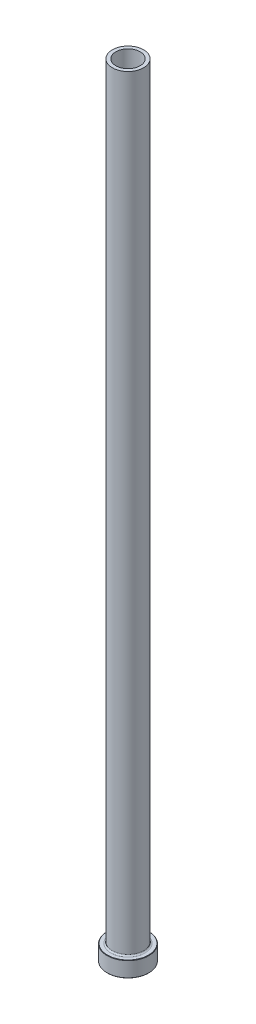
ISO-10303-21;
HEADER;
FILE_DESCRIPTION(('STEP AP214'),'2;1');
FILE_NAME('part.step','',(''),(''),'','','');
FILE_SCHEMA(('AUTOMOTIVE_DESIGN { 1 0 10303 214 1 1 1 1 }'));
ENDSEC;
DATA;
#1=APPLICATION_CONTEXT('core data for automotive mechanical design processes');
#2=APPLICATION_PROTOCOL_DEFINITION('international standard','automotive_design',2000,#1);
#3=PRODUCT_CONTEXT('',#1,'mechanical');
#4=PRODUCT('Part','Part','',(#3));
#5=PRODUCT_RELATED_PRODUCT_CATEGORY('part','',(#4));
#6=PRODUCT_DEFINITION_FORMATION('','',#4);
#7=PRODUCT_DEFINITION_CONTEXT('part definition',#1,'design');
#8=PRODUCT_DEFINITION('design','',#6,#7);
#9=PRODUCT_DEFINITION_SHAPE('','',#8);
#10=(LENGTH_UNIT() NAMED_UNIT(*) SI_UNIT(.MILLI.,.METRE.));
#11=(NAMED_UNIT(*) PLANE_ANGLE_UNIT() SI_UNIT($,.RADIAN.));
#12=(NAMED_UNIT(*) SI_UNIT($,.STERADIAN.) SOLID_ANGLE_UNIT());
#13=UNCERTAINTY_MEASURE_WITH_UNIT(LENGTH_MEASURE(1.E-05),#10,'distance_accuracy_value','');
#14=(GEOMETRIC_REPRESENTATION_CONTEXT(3) GLOBAL_UNCERTAINTY_ASSIGNED_CONTEXT((#13)) GLOBAL_UNIT_ASSIGNED_CONTEXT((#10,
#11,#12)) REPRESENTATION_CONTEXT('',''));
#15=CARTESIAN_POINT('',(0.,0.,0.));
#16=DIRECTION('',(0.,0.,1.));
#17=DIRECTION('',(1.,0.,0.));
#18=AXIS2_PLACEMENT_3D('',#15,#16,#17);
#19=CARTESIAN_POINT('',(0.,92.1876809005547,0.));
#20=DIRECTION('',(0.,1.,0.));
#21=DIRECTION('',(0.,0.,1.));
#22=AXIS2_PLACEMENT_3D('',#19,#20,#21);
#23=CYLINDRICAL_SURFACE('',#22,7.00000000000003);
#24=CARTESIAN_POINT('',(0.,450.,0.));
#25=DIRECTION('',(0.,1.,0.));
#26=DIRECTION('',(0.,0.,1.));
#27=AXIS2_PLACEMENT_3D('',#24,#25,#26);
#28=CIRCLE('',#27,7.00000000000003);
#29=CARTESIAN_POINT('',(0.,450.,7.00000000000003));
#30=VERTEX_POINT('',#29);
#31=EDGE_CURVE('E62',#30,#30,#28,.T.);
#32=ORIENTED_EDGE('',*,*,#31,.T.);
#33=EDGE_LOOP('',(#32));
#34=FACE_BOUND('',#33,.T.);
#35=CARTESIAN_POINT('',(0.,395.,0.));
#36=DIRECTION('',(0.,1.,0.));
#37=DIRECTION('',(0.,0.,1.));
#38=AXIS2_PLACEMENT_3D('',#35,#36,#37);
#39=CIRCLE('',#38,7.00000000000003);
#40=CARTESIAN_POINT('',(0.,395.,7.00000000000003));
#41=VERTEX_POINT('',#40);
#42=EDGE_CURVE('E71',#41,#41,#39,.T.);
#43=ORIENTED_EDGE('',*,*,#42,.F.);
#44=EDGE_LOOP('',(#43));
#45=FACE_BOUND('',#44,.T.);
#46=ADVANCED_FACE('F30',(#34,#45),#23,.F.);
#47=CARTESIAN_POINT('',(-7.00000000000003,450.,0.));
#48=DIRECTION('',(0.,1.,0.));
#49=DIRECTION('',(0.,0.,1.));
#50=AXIS2_PLACEMENT_3D('',#47,#48,#49);
#51=PLANE('',#50);
#52=CARTESIAN_POINT('',(0.,450.,0.));
#53=DIRECTION('',(0.,1.,0.));
#54=DIRECTION('',(0.,0.,1.));
#55=AXIS2_PLACEMENT_3D('',#52,#53,#54);
#56=CIRCLE('',#55,9.00000000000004);
#57=CARTESIAN_POINT('',(0.,450.,9.00000000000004));
#58=VERTEX_POINT('',#57);
#59=EDGE_CURVE('E65',#58,#58,#56,.T.);
#60=ORIENTED_EDGE('',*,*,#59,.T.);
#61=EDGE_LOOP('',(#60));
#62=FACE_BOUND('',#61,.T.);
#63=ORIENTED_EDGE('',*,*,#31,.F.);
#64=EDGE_LOOP('',(#63));
#65=FACE_BOUND('',#64,.T.);
#66=ADVANCED_FACE('F79',(#62,#65),#51,.T.);
#67=CARTESIAN_POINT('',(0.,92.1876809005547,0.));
#68=DIRECTION('',(0.,1.,0.));
#69=DIRECTION('',(0.,0.,1.));
#70=AXIS2_PLACEMENT_3D('',#67,#68,#69);
#71=CYLINDRICAL_SURFACE('',#70,9.00000000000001);
#72=CARTESIAN_POINT('',(0.,9.8,0.));
#73=DIRECTION('',(0.,1.,0.));
#74=DIRECTION('',(0.,0.,1.));
#75=AXIS2_PLACEMENT_3D('',#72,#73,#74);
#76=CIRCLE('',#75,9.00000000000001);
#77=CARTESIAN_POINT('',(0.,9.8,9.00000000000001));
#78=VERTEX_POINT('',#77);
#79=EDGE_CURVE('E59',#78,#78,#76,.T.);
#80=ORIENTED_EDGE('',*,*,#79,.T.);
#81=EDGE_LOOP('',(#80));
#82=FACE_BOUND('',#81,.T.);
#83=ORIENTED_EDGE('',*,*,#59,.F.);
#84=EDGE_LOOP('',(#83));
#85=FACE_BOUND('',#84,.T.);
#86=ADVANCED_FACE('F85',(#82,#85),#71,.T.);
#87=CARTESIAN_POINT('',(-8.99999999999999,9.,0.));
#88=DIRECTION('',(0.,1.,0.));
#89=DIRECTION('',(0.,0.,1.));
#90=AXIS2_PLACEMENT_3D('',#87,#88,#89);
#91=PLANE('',#90);
#92=CARTESIAN_POINT('',(0.,9.,0.));
#93=DIRECTION('',(0.,1.,0.));
#94=DIRECTION('',(0.,0.,1.));
#95=AXIS2_PLACEMENT_3D('',#92,#93,#94);
#96=CIRCLE('',#95,11.8);
#97=CARTESIAN_POINT('',(0.,9.,11.8));
#98=VERTEX_POINT('',#97);
#99=EDGE_CURVE('E53',#98,#98,#96,.T.);
#100=ORIENTED_EDGE('',*,*,#99,.T.);
#101=EDGE_LOOP('',(#100));
#102=FACE_BOUND('',#101,.T.);
#103=CARTESIAN_POINT('',(0.,9.,0.));
#104=DIRECTION('',(0.,1.,0.));
#105=DIRECTION('',(0.,0.,1.));
#106=AXIS2_PLACEMENT_3D('',#103,#104,#105);
#107=CIRCLE('',#106,9.80000000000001);
#108=CARTESIAN_POINT('',(0.,9.,9.80000000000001));
#109=VERTEX_POINT('',#108);
#110=EDGE_CURVE('E56',#109,#109,#107,.F.);
#111=ORIENTED_EDGE('',*,*,#110,.T.);
#112=EDGE_LOOP('',(#111));
#113=FACE_BOUND('',#112,.T.);
#114=ADVANCED_FACE('F111',(#102,#113),#91,.T.);
#115=CARTESIAN_POINT('',(0.,92.1876809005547,0.));
#116=DIRECTION('',(0.,1.,0.));
#117=DIRECTION('',(0.,0.,1.));
#118=AXIS2_PLACEMENT_3D('',#115,#116,#117);
#119=CYLINDRICAL_SURFACE('',#118,12.);
#120=CARTESIAN_POINT('',(0.,8.80000000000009,0.));
#121=DIRECTION('',(0.,1.,0.));
#122=DIRECTION('',(0.,0.,1.));
#123=AXIS2_PLACEMENT_3D('',#120,#121,#122);
#124=CIRCLE('',#123,12.);
#125=CARTESIAN_POINT('',(0.,8.80000000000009,12.));
#126=VERTEX_POINT('',#125);
#127=EDGE_CURVE('E45',#126,#126,#124,.F.);
#128=CARTESIAN_POINT('',(0.,0.199999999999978,0.));
#129=DIRECTION('',(0.,-1.,0.));
#130=DIRECTION('',(0.,0.,-1.));
#131=AXIS2_PLACEMENT_3D('',#128,#129,#130);
#132=CIRCLE('',#131,12.);
#133=CARTESIAN_POINT('',(0.,0.199999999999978,12.));
#134=VERTEX_POINT('',#133);
#135=EDGE_CURVE('E50',#134,#134,#132,.F.);
#136=CARTESIAN_POINT('',(0.,8.80000000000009,12.));
#137=CARTESIAN_POINT('',(0.,8.71041666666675,12.));
#138=CARTESIAN_POINT('',(0.,8.62083333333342,12.));
#139=CARTESIAN_POINT('',(0.,8.44166666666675,12.));
#140=CARTESIAN_POINT('',(0.,8.35208333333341,12.));
#141=CARTESIAN_POINT('',(0.,8.17291666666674,12.));
#142=CARTESIAN_POINT('',(0.,8.08333333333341,12.));
#143=CARTESIAN_POINT('',(0.,7.90416666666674,12.));
#144=CARTESIAN_POINT('',(0.,7.8145833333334,12.));
#145=CARTESIAN_POINT('',(0.,7.63541666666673,12.));
#146=CARTESIAN_POINT('',(0.,7.5458333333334,12.));
#147=CARTESIAN_POINT('',(0.,7.36666666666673,12.));
#148=CARTESIAN_POINT('',(0.,7.2770833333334,12.));
#149=CARTESIAN_POINT('',(0.,7.09791666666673,12.));
#150=CARTESIAN_POINT('',(0.,7.00833333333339,12.));
#151=CARTESIAN_POINT('',(0.,6.82916666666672,12.));
#152=CARTESIAN_POINT('',(0.,6.73958333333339,12.));
#153=CARTESIAN_POINT('',(0.,6.56041666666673,12.));
#154=CARTESIAN_POINT('',(0.,6.47083333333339,12.));
#155=CARTESIAN_POINT('',(0.,6.29166666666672,12.));
#156=CARTESIAN_POINT('',(0.,6.20208333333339,12.));
#157=CARTESIAN_POINT('',(0.,6.02291666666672,12.));
#158=CARTESIAN_POINT('',(0.,5.93333333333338,12.));
#159=CARTESIAN_POINT('',(0.,5.75416666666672,12.));
#160=CARTESIAN_POINT('',(0.,5.66458333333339,12.));
#161=CARTESIAN_POINT('',(0.,5.48541666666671,12.));
#162=CARTESIAN_POINT('',(0.,5.39583333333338,12.));
#163=CARTESIAN_POINT('',(0.,5.21666666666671,12.));
#164=CARTESIAN_POINT('',(0.,5.12708333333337,12.));
#165=CARTESIAN_POINT('',(0.,4.9479166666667,12.));
#166=CARTESIAN_POINT('',(0.,4.85833333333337,12.));
#167=CARTESIAN_POINT('',(0.,4.6791666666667,12.));
#168=CARTESIAN_POINT('',(0.,4.58958333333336,12.));
#169=CARTESIAN_POINT('',(0.,4.4104166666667,12.));
#170=CARTESIAN_POINT('',(0.,4.32083333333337,12.));
#171=CARTESIAN_POINT('',(0.,4.1416666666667,12.));
#172=CARTESIAN_POINT('',(0.,4.05208333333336,12.));
#173=CARTESIAN_POINT('',(0.,3.87291666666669,12.));
#174=CARTESIAN_POINT('',(0.,3.78333333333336,12.));
#175=CARTESIAN_POINT('',(0.,3.60416666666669,12.));
#176=CARTESIAN_POINT('',(0.,3.51458333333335,12.));
#177=CARTESIAN_POINT('',(0.,3.33541666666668,12.));
#178=CARTESIAN_POINT('',(0.,3.24583333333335,12.));
#179=CARTESIAN_POINT('',(0.,3.06666666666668,12.));
#180=CARTESIAN_POINT('',(0.,2.97708333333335,12.));
#181=CARTESIAN_POINT('',(0.,2.79791666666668,12.));
#182=CARTESIAN_POINT('',(0.,2.70833333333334,12.));
#183=CARTESIAN_POINT('',(0.,2.52916666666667,12.));
#184=CARTESIAN_POINT('',(0.,2.43958333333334,12.));
#185=CARTESIAN_POINT('',(0.,2.26041666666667,12.));
#186=CARTESIAN_POINT('',(0.,2.17083333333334,12.));
#187=CARTESIAN_POINT('',(0.,1.99166666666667,12.));
#188=CARTESIAN_POINT('',(0.,1.90208333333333,12.));
#189=CARTESIAN_POINT('',(0.,1.72291666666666,12.));
#190=CARTESIAN_POINT('',(0.,1.63333333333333,12.));
#191=CARTESIAN_POINT('',(0.,1.45416666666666,12.));
#192=CARTESIAN_POINT('',(0.,1.36458333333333,12.));
#193=CARTESIAN_POINT('',(0.,1.18541666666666,12.));
#194=CARTESIAN_POINT('',(0.,1.09583333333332,12.));
#195=CARTESIAN_POINT('',(0.,0.916666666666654,12.));
#196=CARTESIAN_POINT('',(0.,0.827083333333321,12.));
#197=CARTESIAN_POINT('',(0.,0.647916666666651,12.));
#198=CARTESIAN_POINT('',(0.,0.558333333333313,12.));
#199=CARTESIAN_POINT('',(0.,0.379166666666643,12.));
#200=CARTESIAN_POINT('',(0.,0.289583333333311,12.));
#201=CARTESIAN_POINT('',(0.,0.199999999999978,12.));
#202=B_SPLINE_CURVE_WITH_KNOTS('',3,(#136,#137,#138,#139,#140,#141,#142,#143,#144,#145,#146,
#147,#148,#149,#150,#151,#152,#153,#154,#155,#156,#157,#158,#159,#160,#161,#162,#163,#164,#165,
#166,#167,#168,#169,#170,#171,#172,#173,#174,#175,#176,#177,#178,#179,#180,#181,#182,#183,#184,
#185,#186,#187,#188,#189,#190,#191,#192,#193,#194,#195,#196,#197,#198,#199,#200,#201),
.UNSPECIFIED.,.F.,.F.,(4,2,2,2,2,2,2,2,2,2,2,2,2,2,2,2,2,2,2,2,2,2,2,2,2,2,2,2,2,2,2,2,4),(0.,
0.268749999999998,0.53750000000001,0.806250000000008,1.07500000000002,1.34375000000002,
1.61250000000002,1.88125000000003,2.15000000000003,2.41875000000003,2.68750000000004,
2.95625000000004,3.22500000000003,3.49375000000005,3.76250000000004,4.03125000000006,
4.30000000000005,4.56875000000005,4.83750000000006,5.10625000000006,5.37500000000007,
5.64375000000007,5.91250000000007,6.18125000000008,6.45000000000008,6.71875000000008,
6.98750000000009,7.25625000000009,7.52500000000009,7.7937500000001,8.0625000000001,
8.33125000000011,8.60000000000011),.UNSPECIFIED.);
#203=EDGE_CURVE('BSEAM108',#126,#134,#202,.T.);
#204=ORIENTED_EDGE('',*,*,#127,.T.);
#205=ORIENTED_EDGE('',*,*,#135,.T.);
#206=ORIENTED_EDGE('',*,*,#203,.T.);
#207=ORIENTED_EDGE('',*,*,#203,.F.);
#208=EDGE_LOOP('',(#204,#206,#205,#207));
#209=FACE_BOUND('',#208,.T.);
#210=ADVANCED_FACE('F108',(#209),#119,.T.);
#211=CARTESIAN_POINT('',(-12.,0.,0.));
#212=DIRECTION('',(0.,-1.,0.));
#213=DIRECTION('',(0.,0.,-1.));
#214=AXIS2_PLACEMENT_3D('',#211,#212,#213);
#215=PLANE('',#214);
#216=CARTESIAN_POINT('',(0.,0.,0.));
#217=DIRECTION('',(0.,-1.,0.));
#218=DIRECTION('',(0.,0.,-1.));
#219=AXIS2_PLACEMENT_3D('',#216,#217,#218);
#220=CIRCLE('',#219,7.74999999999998);
#221=CARTESIAN_POINT('',(0.,0.,-7.74999999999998));
#222=VERTEX_POINT('',#221);
#223=EDGE_CURVE('E37',#222,#222,#220,.F.);
#224=ORIENTED_EDGE('',*,*,#223,.T.);
#225=EDGE_LOOP('',(#224));
#226=FACE_BOUND('',#225,.T.);
#227=CARTESIAN_POINT('',(0.,0.,0.));
#228=DIRECTION('',(0.,-1.,0.));
#229=DIRECTION('',(0.,0.,-1.));
#230=AXIS2_PLACEMENT_3D('',#227,#228,#229);
#231=CIRCLE('',#230,11.8);
#232=CARTESIAN_POINT('',(0.,0.,11.8));
#233=VERTEX_POINT('',#232);
#234=EDGE_CURVE('E41',#233,#233,#231,.T.);
#235=ORIENTED_EDGE('',*,*,#234,.T.);
#236=EDGE_LOOP('',(#235));
#237=FACE_BOUND('',#236,.T.);
#238=ADVANCED_FACE('F110',(#226,#237),#215,.T.);
#239=CARTESIAN_POINT('',(0.,92.1876809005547,0.));
#240=DIRECTION('',(0.,1.,0.));
#241=DIRECTION('',(0.,0.,1.));
#242=AXIS2_PLACEMENT_3D('',#239,#240,#241);
#243=CYLINDRICAL_SURFACE('',#242,7.25000000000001);
#244=CARTESIAN_POINT('',(0.,0.5,0.));
#245=DIRECTION('',(0.,-1.,0.));
#246=DIRECTION('',(0.,0.,-1.));
#247=AXIS2_PLACEMENT_3D('',#244,#245,#246);
#248=CIRCLE('',#247,7.25000000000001);
#249=CARTESIAN_POINT('',(0.,0.5,-7.25000000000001));
#250=VERTEX_POINT('',#249);
#251=EDGE_CURVE('E10',#250,#250,#248,.T.);
#252=ORIENTED_EDGE('',*,*,#251,.T.);
#253=EDGE_LOOP('',(#252));
#254=FACE_BOUND('',#253,.T.);
#255=CARTESIAN_POINT('',(0.,383.,0.));
#256=DIRECTION('',(0.,1.,0.));
#257=DIRECTION('',(0.,0.,1.));
#258=AXIS2_PLACEMENT_3D('',#255,#256,#257);
#259=CIRCLE('',#258,7.25000000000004);
#260=CARTESIAN_POINT('',(0.,383.,7.25000000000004));
#261=VERTEX_POINT('',#260);
#262=EDGE_CURVE('E68',#261,#261,#259,.T.);
#263=ORIENTED_EDGE('',*,*,#262,.T.);
#264=EDGE_LOOP('',(#263));
#265=FACE_BOUND('',#264,.T.);
#266=ADVANCED_FACE('F118',(#254,#265),#243,.F.);
#267=CARTESIAN_POINT('',(0.,383.,0.));
#268=DIRECTION('',(0.,-1.,0.));
#269=DIRECTION('',(0.,0.,-1.));
#270=AXIS2_PLACEMENT_3D('',#267,#268,#269);
#271=CONICAL_SURFACE('',#270,7.25000000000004,0.0208303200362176);
#272=ORIENTED_EDGE('',*,*,#42,.T.);
#273=EDGE_LOOP('',(#272));
#274=FACE_BOUND('',#273,.T.);
#275=ORIENTED_EDGE('',*,*,#262,.F.);
#276=EDGE_LOOP('',(#275));
#277=FACE_BOUND('',#276,.T.);
#278=ADVANCED_FACE('F75',(#274,#277),#271,.F.);
#279=CARTESIAN_POINT('',(0.,9.8,0.));
#280=DIRECTION('',(0.,1.,0.));
#281=DIRECTION('',(0.,0.,1.));
#282=AXIS2_PLACEMENT_3D('',#279,#280,#281);
#283=TOROIDAL_SURFACE('',#282,9.80000000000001,0.8);
#284=ORIENTED_EDGE('',*,*,#110,.F.);
#285=EDGE_LOOP('',(#284));
#286=FACE_BOUND('',#285,.T.);
#287=ORIENTED_EDGE('',*,*,#79,.F.);
#288=EDGE_LOOP('',(#287));
#289=FACE_BOUND('',#288,.T.);
#290=ADVANCED_FACE('F90',(#286,#289),#283,.F.);
#291=CARTESIAN_POINT('',(0.,9.00000000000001,0.));
#292=DIRECTION('',(0.,-1.,0.));
#293=DIRECTION('',(0.,0.,-1.));
#294=AXIS2_PLACEMENT_3D('',#291,#292,#293);
#295=CONICAL_SURFACE('',#294,11.8,0.785398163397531);
#296=ORIENTED_EDGE('',*,*,#127,.F.);
#297=EDGE_LOOP('',(#296));
#298=FACE_BOUND('',#297,.T.);
#299=ORIENTED_EDGE('',*,*,#99,.F.);
#300=EDGE_LOOP('',(#299));
#301=FACE_BOUND('',#300,.T.);
#302=ADVANCED_FACE('F93',(#298,#301),#295,.T.);
#303=CARTESIAN_POINT('',(0.,0.199999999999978,0.));
#304=DIRECTION('',(0.,1.,0.));
#305=DIRECTION('',(0.,0.,1.));
#306=AXIS2_PLACEMENT_3D('',#303,#304,#305);
#307=CONICAL_SURFACE('',#306,12.,0.785398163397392);
#308=CARTESIAN_POINT('',(0.,0.,11.8));
#309=CARTESIAN_POINT('',(0.,0.00208333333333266,11.8020833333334));
#310=CARTESIAN_POINT('',(0.,0.00416666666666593,11.8041666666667));
#311=CARTESIAN_POINT('',(0.,0.00833333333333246,11.8083333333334));
#312=CARTESIAN_POINT('',(0.,0.0104166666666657,11.8104166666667));
#313=CARTESIAN_POINT('',(0.,0.0145833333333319,11.8145833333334));
#314=CARTESIAN_POINT('',(0.,0.0166666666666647,11.8166666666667));
#315=CARTESIAN_POINT('',(0.,0.0208333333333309,11.8208333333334));
#316=CARTESIAN_POINT('',(0.,0.0229166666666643,11.8229166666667));
#317=CARTESIAN_POINT('',(0.,0.0270833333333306,11.8270833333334));
#318=CARTESIAN_POINT('',(0.,0.0291666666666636,11.8291666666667));
#319=CARTESIAN_POINT('',(0.,0.0333333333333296,11.8333333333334));
#320=CARTESIAN_POINT('',(0.,0.0354166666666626,11.8354166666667));
#321=CARTESIAN_POINT('',(0.,0.0395833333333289,11.8395833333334));
#322=CARTESIAN_POINT('',(0.,0.0416666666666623,11.8416666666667));
#323=CARTESIAN_POINT('',(0.,0.0458333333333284,11.8458333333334));
#324=CARTESIAN_POINT('',(0.,0.0479166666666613,11.8479166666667));
#325=CARTESIAN_POINT('',(0.,0.0520833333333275,11.8520833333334));
#326=CARTESIAN_POINT('',(0.,0.0541666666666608,11.8541666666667));
#327=CARTESIAN_POINT('',(0.,0.0583333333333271,11.8583333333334));
#328=CARTESIAN_POINT('',(0.,0.0604166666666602,11.8604166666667));
#329=CARTESIAN_POINT('',(0.,0.0645833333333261,11.8645833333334));
#330=CARTESIAN_POINT('',(0.,0.0666666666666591,11.8666666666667));
#331=CARTESIAN_POINT('',(0.,0.0708333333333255,11.8708333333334));
#332=CARTESIAN_POINT('',(0.,0.0729166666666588,11.8729166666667));
#333=CARTESIAN_POINT('',(0.,0.077083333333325,11.8770833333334));
#334=CARTESIAN_POINT('',(0.,0.0791666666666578,11.8791666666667));
#335=CARTESIAN_POINT('',(0.,0.083333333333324,11.8833333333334));
#336=CARTESIAN_POINT('',(0.,0.0854166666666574,11.8854166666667));
#337=CARTESIAN_POINT('',(0.,0.0895833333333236,11.8895833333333));
#338=CARTESIAN_POINT('',(0.,0.0916666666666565,11.8916666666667));
#339=CARTESIAN_POINT('',(0.,0.0958333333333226,11.8958333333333));
#340=CARTESIAN_POINT('',(0.,0.097916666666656,11.8979166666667));
#341=CARTESIAN_POINT('',(0.,0.102083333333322,11.9020833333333));
#342=CARTESIAN_POINT('',(0.,0.104166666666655,11.9041666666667));
#343=CARTESIAN_POINT('',(0.,0.108333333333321,11.9083333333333));
#344=CARTESIAN_POINT('',(0.,0.110416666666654,11.9104166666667));
#345=CARTESIAN_POINT('',(0.,0.114583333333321,11.9145833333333));
#346=CARTESIAN_POINT('',(0.,0.116666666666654,11.9166666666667));
#347=CARTESIAN_POINT('',(0.,0.12083333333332,11.9208333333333));
#348=CARTESIAN_POINT('',(0.,0.122916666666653,11.9229166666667));
#349=CARTESIAN_POINT('',(0.,0.127083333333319,11.9270833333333));
#350=CARTESIAN_POINT('',(0.,0.129166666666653,11.9291666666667));
#351=CARTESIAN_POINT('',(0.,0.133333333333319,11.9333333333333));
#352=CARTESIAN_POINT('',(0.,0.135416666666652,11.9354166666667));
#353=CARTESIAN_POINT('',(0.,0.139583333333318,11.9395833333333));
#354=CARTESIAN_POINT('',(0.,0.141666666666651,11.9416666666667));
#355=CARTESIAN_POINT('',(0.,0.145833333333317,11.9458333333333));
#356=CARTESIAN_POINT('',(0.,0.147916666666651,11.9479166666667));
#357=CARTESIAN_POINT('',(0.,0.152083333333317,11.9520833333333));
#358=CARTESIAN_POINT('',(0.,0.15416666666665,11.9541666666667));
#359=CARTESIAN_POINT('',(0.,0.158333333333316,11.9583333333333));
#360=CARTESIAN_POINT('',(0.,0.160416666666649,11.9604166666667));
#361=CARTESIAN_POINT('',(0.,0.164583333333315,11.9645833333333));
#362=CARTESIAN_POINT('',(0.,0.166666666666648,11.9666666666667));
#363=CARTESIAN_POINT('',(0.,0.170833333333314,11.9708333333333));
#364=CARTESIAN_POINT('',(0.,0.172916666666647,11.9729166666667));
#365=CARTESIAN_POINT('',(0.,0.177083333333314,11.9770833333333));
#366=CARTESIAN_POINT('',(0.,0.179166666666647,11.9791666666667));
#367=CARTESIAN_POINT('',(0.,0.183333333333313,11.9833333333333));
#368=CARTESIAN_POINT('',(0.,0.185416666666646,11.9854166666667));
#369=CARTESIAN_POINT('',(0.,0.189583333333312,11.9895833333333));
#370=CARTESIAN_POINT('',(0.,0.191666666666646,11.9916666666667));
#371=CARTESIAN_POINT('',(0.,0.195833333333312,11.9958333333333));
#372=CARTESIAN_POINT('',(0.,0.197916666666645,11.9979166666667));
#373=CARTESIAN_POINT('',(0.,0.199999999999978,12.));
#374=B_SPLINE_CURVE_WITH_KNOTS('',3,(#308,#309,#310,#311,#312,#313,#314,#315,#316,#317,#318,
#319,#320,#321,#322,#323,#324,#325,#326,#327,#328,#329,#330,#331,#332,#333,#334,#335,#336,#337,
#338,#339,#340,#341,#342,#343,#344,#345,#346,#347,#348,#349,#350,#351,#352,#353,#354,#355,#356,
#357,#358,#359,#360,#361,#362,#363,#364,#365,#366,#367,#368,#369,#370,#371,#372,#373),
.UNSPECIFIED.,.F.,.F.,(4,2,2,2,2,2,2,2,2,2,2,2,2,2,2,2,2,2,2,2,2,2,2,2,2,2,2,2,2,2,2,2,4),(0.,
0.00883883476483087,0.0176776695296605,0.0265165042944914,0.035355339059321,0.0441941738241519,
0.0530330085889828,0.0618718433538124,0.0707106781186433,0.0795495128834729,0.0883883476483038,
0.0972271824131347,0.106066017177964,0.114904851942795,0.123743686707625,0.132582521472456,
0.141421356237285,0.150260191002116,0.159099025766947,0.167937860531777,0.176776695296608,
0.185615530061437,0.194454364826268,0.203293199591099,0.212132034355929,0.220970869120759,
0.229809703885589,0.23864853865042,0.247487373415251,0.25632620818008,0.265165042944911,
0.274003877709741,0.282842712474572),.UNSPECIFIED.);
#375=EDGE_CURVE('BSEAM96',#233,#134,#374,.T.);
#376=ORIENTED_EDGE('',*,*,#234,.F.);
#377=ORIENTED_EDGE('',*,*,#135,.F.);
#378=ORIENTED_EDGE('',*,*,#375,.T.);
#379=ORIENTED_EDGE('',*,*,#375,.F.);
#380=EDGE_LOOP('',(#376,#378,#377,#379));
#381=FACE_BOUND('',#380,.T.);
#382=ADVANCED_FACE('F96',(#381),#307,.T.);
#383=CARTESIAN_POINT('',(0.,0.,0.));
#384=DIRECTION('',(0.,-1.,0.));
#385=DIRECTION('',(0.,0.,-1.));
#386=AXIS2_PLACEMENT_3D('',#383,#384,#385);
#387=CONICAL_SURFACE('',#386,7.74999999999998,0.785398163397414);
#388=ORIENTED_EDGE('',*,*,#251,.F.);
#389=EDGE_LOOP('',(#388));
#390=FACE_BOUND('',#389,.T.);
#391=ORIENTED_EDGE('',*,*,#223,.F.);
#392=EDGE_LOOP('',(#391));
#393=FACE_BOUND('',#392,.T.);
#394=ADVANCED_FACE('F32',(#390,#393),#387,.F.);
#395=CLOSED_SHELL('',(#46,#66,#86,#114,#210,#238,#266,#278,#290,#302,#382,#394));
#396=MANIFOLD_SOLID_BREP('B2',#395);
#397=ADVANCED_BREP_SHAPE_REPRESENTATION('',(#18,#396),#14);
#398=SHAPE_DEFINITION_REPRESENTATION(#9,#397);
ENDSEC;
END-ISO-10303-21;
